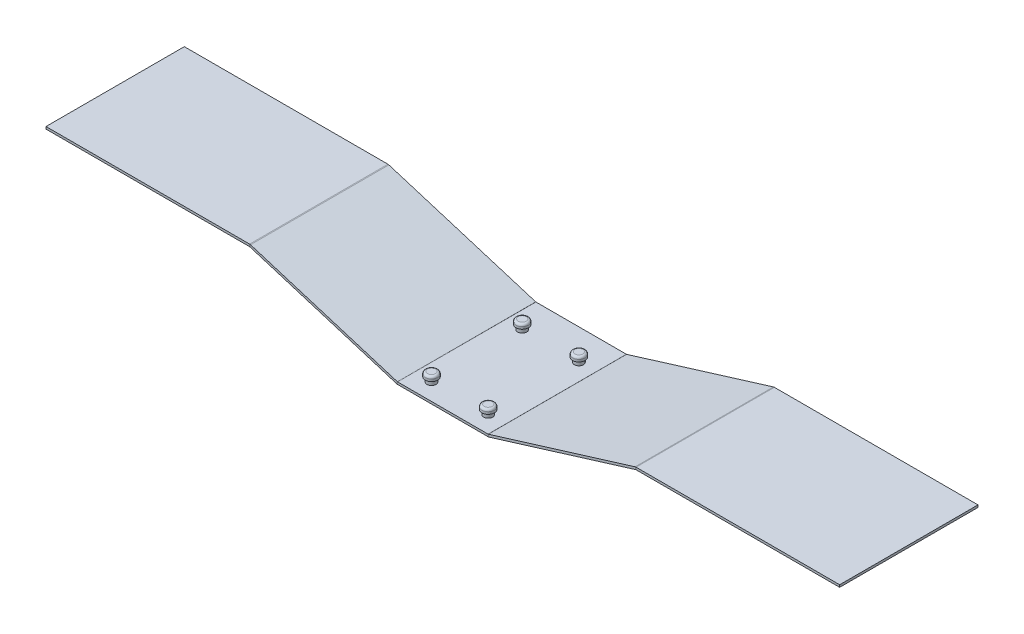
ISO-10303-21;
HEADER;
FILE_DESCRIPTION(('STEP AP214'),'2;1');
FILE_NAME('part.step','',(''),(''),'','','');
FILE_SCHEMA(('AUTOMOTIVE_DESIGN { 1 0 10303 214 1 1 1 1 }'));
ENDSEC;
DATA;
#1=APPLICATION_CONTEXT('core data for automotive mechanical design processes');
#2=APPLICATION_PROTOCOL_DEFINITION('international standard','automotive_design',2000,#1);
#3=PRODUCT_CONTEXT('',#1,'mechanical');
#4=PRODUCT('Part','Part','',(#3));
#5=PRODUCT_RELATED_PRODUCT_CATEGORY('part','',(#4));
#6=PRODUCT_DEFINITION_FORMATION('','',#4);
#7=PRODUCT_DEFINITION_CONTEXT('part definition',#1,'design');
#8=PRODUCT_DEFINITION('design','',#6,#7);
#9=PRODUCT_DEFINITION_SHAPE('','',#8);
#10=(LENGTH_UNIT() NAMED_UNIT(*) SI_UNIT(.MILLI.,.METRE.));
#11=(NAMED_UNIT(*) PLANE_ANGLE_UNIT() SI_UNIT($,.RADIAN.));
#12=(NAMED_UNIT(*) SI_UNIT($,.STERADIAN.) SOLID_ANGLE_UNIT());
#13=UNCERTAINTY_MEASURE_WITH_UNIT(LENGTH_MEASURE(1.E-05),#10,'distance_accuracy_value','');
#14=(GEOMETRIC_REPRESENTATION_CONTEXT(3) GLOBAL_UNCERTAINTY_ASSIGNED_CONTEXT((#13)) GLOBAL_UNIT_ASSIGNED_CONTEXT((#10,
#11,#12)) REPRESENTATION_CONTEXT('',''));
#15=CARTESIAN_POINT('',(0.,0.,0.));
#16=DIRECTION('',(0.,0.,1.));
#17=DIRECTION('',(1.,0.,0.));
#18=AXIS2_PLACEMENT_3D('',#15,#16,#17);
#19=CARTESIAN_POINT('',(180.393299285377,-0.121015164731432,122.));
#20=DIRECTION('',(0.,0.,1.));
#21=DIRECTION('',(1.,0.,0.));
#22=AXIS2_PLACEMENT_3D('',#19,#20,#21);
#23=PLANE('',#22);
#24=DIRECTION('',(-0.294085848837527,-0.955779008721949,0.));
#25=VECTOR('',#24,1.);
#26=CARTESIAN_POINT('',(180.393299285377,-0.121015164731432,122.));
#27=LINE('',#26,#25);
#28=CARTESIAN_POINT('',(180.393299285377,-0.121015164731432,122.));
#29=VERTEX_POINT('',#28);
#30=CARTESIAN_POINT('',(179.805127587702,-2.03257318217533,122.));
#31=VERTEX_POINT('',#30);
#32=EDGE_CURVE('E350',#29,#31,#27,.T.);
#33=ORIENTED_EDGE('',*,*,#32,.F.);
#34=CARTESIAN_POINT('',(179.588503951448,-2.73659999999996,122.));
#35=DIRECTION('',(0.,0.,1.));
#36=DIRECTION('',(1.,0.,0.));
#37=AXIS2_PLACEMENT_3D('',#34,#35,#36);
#38=CIRCLE('',#37,2.7366);
#39=CARTESIAN_POINT('',(179.588503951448,0.,122.));
#40=VERTEX_POINT('',#39);
#41=EDGE_CURVE('E630',#40,#29,#38,.F.);
#42=ORIENTED_EDGE('',*,*,#41,.F.);
#43=DIRECTION('',(0.,1.,0.));
#44=VECTOR('',#43,1.);
#45=CARTESIAN_POINT('',(179.588503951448,-1.99999999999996,122.));
#46=LINE('',#45,#44);
#47=CARTESIAN_POINT('',(179.588503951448,-1.99999999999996,122.));
#48=VERTEX_POINT('',#47);
#49=EDGE_CURVE('E348',#48,#40,#46,.T.);
#50=ORIENTED_EDGE('',*,*,#49,.F.);
#51=CARTESIAN_POINT('',(179.588503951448,-2.73659999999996,122.));
#52=DIRECTION('',(0.,0.,1.));
#53=DIRECTION('',(1.,0.,0.));
#54=AXIS2_PLACEMENT_3D('',#51,#52,#53);
#55=CIRCLE('',#54,0.7366);
#56=EDGE_CURVE('E639',#48,#31,#55,.F.);
#57=ORIENTED_EDGE('',*,*,#56,.T.);
#58=EDGE_LOOP('',(#33,#42,#50,#57));
#59=FACE_BOUND('',#58,.T.);
#60=ADVANCED_FACE('F34',(#59),#23,.T.);
#61=CARTESIAN_POINT('',(179.588503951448,-1.99999999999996,122.));
#62=DIRECTION('',(0.,0.,1.));
#63=DIRECTION('',(1.,0.,0.));
#64=AXIS2_PLACEMENT_3D('',#61,#62,#63);
#65=PLANE('',#64);
#66=DIRECTION('',(0.95577900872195,-0.294085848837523,0.));
#67=VECTOR('',#66,1.);
#68=CARTESIAN_POINT('',(180.,0.,122.));
#69=LINE('',#68,#67);
#70=CARTESIAN_POINT('',(309.89413715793,-39.9674268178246,122.));
#71=VERTEX_POINT('',#70);
#72=EDGE_CURVE('E634',#29,#71,#69,.T.);
#73=ORIENTED_EDGE('',*,*,#72,.F.);
#74=ORIENTED_EDGE('',*,*,#32,.T.);
#75=DIRECTION('',(0.95577900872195,-0.294085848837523,0.));
#76=VECTOR('',#75,1.);
#77=CARTESIAN_POINT('',(179.411828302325,-1.9115580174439,122.));
#78=LINE('',#77,#76);
#79=CARTESIAN_POINT('',(309.305965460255,-41.8789848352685,122.));
#80=VERTEX_POINT('',#79);
#81=EDGE_CURVE('E642',#31,#80,#78,.T.);
#82=ORIENTED_EDGE('',*,*,#81,.T.);
#83=DIRECTION('',(0.294085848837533,0.955779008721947,0.));
#84=VECTOR('',#83,1.);
#85=CARTESIAN_POINT('',(309.305965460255,-41.8789848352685,122.));
#86=LINE('',#85,#84);
#87=EDGE_CURVE('E340',#80,#71,#86,.T.);
#88=ORIENTED_EDGE('',*,*,#87,.T.);
#89=EDGE_LOOP('',(#73,#74,#82,#88));
#90=FACE_BOUND('',#89,.T.);
#91=ADVANCED_FACE('F407',(#90),#65,.T.);
#92=CARTESIAN_POINT('',(179.588503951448,0.,0.));
#93=DIRECTION('',(0.,0.,-1.));
#94=DIRECTION('',(-1.,0.,0.));
#95=AXIS2_PLACEMENT_3D('',#92,#93,#94);
#96=PLANE('',#95);
#97=DIRECTION('',(0.,-1.,0.));
#98=VECTOR('',#97,1.);
#99=CARTESIAN_POINT('',(179.588503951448,0.,0.));
#100=LINE('',#99,#98);
#101=CARTESIAN_POINT('',(179.588503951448,0.,0.));
#102=VERTEX_POINT('',#101);
#103=CARTESIAN_POINT('',(179.588503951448,-1.99999999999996,0.));
#104=VERTEX_POINT('',#103);
#105=EDGE_CURVE('E346',#102,#104,#100,.T.);
#106=ORIENTED_EDGE('',*,*,#105,.F.);
#107=CARTESIAN_POINT('',(179.588503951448,-2.73659999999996,0.));
#108=DIRECTION('',(0.,0.,1.));
#109=DIRECTION('',(1.,0.,0.));
#110=AXIS2_PLACEMENT_3D('',#107,#108,#109);
#111=CIRCLE('',#110,2.7366);
#112=CARTESIAN_POINT('',(180.393299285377,-0.121015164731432,0.));
#113=VERTEX_POINT('',#112);
#114=EDGE_CURVE('E250',#102,#113,#111,.F.);
#115=ORIENTED_EDGE('',*,*,#114,.T.);
#116=DIRECTION('',(0.294085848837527,0.955779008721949,0.));
#117=VECTOR('',#116,1.);
#118=CARTESIAN_POINT('',(179.805127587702,-2.03257318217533,0.));
#119=LINE('',#118,#117);
#120=CARTESIAN_POINT('',(179.805127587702,-2.03257318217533,0.));
#121=VERTEX_POINT('',#120);
#122=EDGE_CURVE('E344',#121,#113,#119,.T.);
#123=ORIENTED_EDGE('',*,*,#122,.F.);
#124=CARTESIAN_POINT('',(179.588503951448,-2.73659999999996,0.));
#125=DIRECTION('',(0.,0.,1.));
#126=DIRECTION('',(1.,0.,0.));
#127=AXIS2_PLACEMENT_3D('',#124,#125,#126);
#128=CIRCLE('',#127,0.7366);
#129=EDGE_CURVE('E262',#104,#121,#128,.F.);
#130=ORIENTED_EDGE('',*,*,#129,.F.);
#131=EDGE_LOOP('',(#106,#115,#123,#130));
#132=FACE_BOUND('',#131,.T.);
#133=ADVANCED_FACE('F413',(#132),#96,.T.);
#134=CARTESIAN_POINT('',(179.805127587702,-2.03257318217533,0.));
#135=DIRECTION('',(0.,0.,-1.));
#136=DIRECTION('',(-1.,0.,0.));
#137=AXIS2_PLACEMENT_3D('',#134,#135,#136);
#138=PLANE('',#137);
#139=DIRECTION('',(1.,0.,0.));
#140=VECTOR('',#139,1.);
#141=CARTESIAN_POINT('',(0.,0.,0.));
#142=LINE('',#141,#140);
#143=CARTESIAN_POINT('',(0.,0.,0.));
#144=VERTEX_POINT('',#143);
#145=EDGE_CURVE('E253',#144,#102,#142,.T.);
#146=ORIENTED_EDGE('',*,*,#145,.T.);
#147=ORIENTED_EDGE('',*,*,#105,.T.);
#148=DIRECTION('',(1.,0.,0.));
#149=VECTOR('',#148,1.);
#150=CARTESIAN_POINT('',(0.,-2.,0.));
#151=LINE('',#150,#149);
#152=CARTESIAN_POINT('',(0.,-2.,0.));
#153=VERTEX_POINT('',#152);
#154=EDGE_CURVE('E259',#153,#104,#151,.T.);
#155=ORIENTED_EDGE('',*,*,#154,.F.);
#156=DIRECTION('',(0.,1.,0.));
#157=VECTOR('',#156,1.);
#158=CARTESIAN_POINT('',(0.,-2.,0.));
#159=LINE('',#158,#157);
#160=EDGE_CURVE('E256',#153,#144,#159,.T.);
#161=ORIENTED_EDGE('',*,*,#160,.T.);
#162=EDGE_LOOP('',(#146,#147,#155,#161));
#163=FACE_BOUND('',#162,.T.);
#164=ADVANCED_FACE('F604',(#163),#138,.T.);
#165=CARTESIAN_POINT('',(310.110760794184,-40.,122.));
#166=DIRECTION('',(0.,0.,1.));
#167=DIRECTION('',(1.,0.,0.));
#168=AXIS2_PLACEMENT_3D('',#165,#166,#167);
#169=PLANE('',#168);
#170=DIRECTION('',(0.,-1.,0.));
#171=VECTOR('',#170,1.);
#172=CARTESIAN_POINT('',(310.110760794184,-40.,122.));
#173=LINE('',#172,#171);
#174=CARTESIAN_POINT('',(310.110760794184,-40.,122.));
#175=VERTEX_POINT('',#174);
#176=CARTESIAN_POINT('',(310.110760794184,-42.,122.));
#177=VERTEX_POINT('',#176);
#178=EDGE_CURVE('E342',#175,#177,#173,.T.);
#179=ORIENTED_EDGE('',*,*,#178,.F.);
#180=CARTESIAN_POINT('',(310.110760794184,-39.2634,122.));
#181=DIRECTION('',(0.,0.,-1.));
#182=DIRECTION('',(-1.,0.,0.));
#183=AXIS2_PLACEMENT_3D('',#180,#181,#182);
#184=CIRCLE('',#183,0.7366);
#185=EDGE_CURVE('E680',#71,#175,#184,.F.);
#186=ORIENTED_EDGE('',*,*,#185,.F.);
#187=ORIENTED_EDGE('',*,*,#87,.F.);
#188=CARTESIAN_POINT('',(310.110760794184,-39.2634,122.));
#189=DIRECTION('',(0.,0.,1.));
#190=DIRECTION('',(1.,0.,0.));
#191=AXIS2_PLACEMENT_3D('',#188,#189,#190);
#192=CIRCLE('',#191,2.7366);
#193=EDGE_CURVE('E645',#80,#177,#192,.T.);
#194=ORIENTED_EDGE('',*,*,#193,.T.);
#195=EDGE_LOOP('',(#179,#186,#187,#194));
#196=FACE_BOUND('',#195,.T.);
#197=ADVANCED_FACE('F600',(#196),#169,.T.);
#198=CARTESIAN_POINT('',(309.305965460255,-41.8789848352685,122.));
#199=DIRECTION('',(0.,0.,1.));
#200=DIRECTION('',(1.,0.,0.));
#201=AXIS2_PLACEMENT_3D('',#198,#199,#200);
#202=PLANE('',#201);
#203=DIRECTION('',(1.,0.,0.));
#204=VECTOR('',#203,1.);
#205=CARTESIAN_POINT('',(310.,-40.,122.));
#206=LINE('',#205,#204);
#207=CARTESIAN_POINT('',(389.889239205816,-40.,122.));
#208=VERTEX_POINT('',#207);
#209=EDGE_CURVE('E677',#175,#208,#206,.T.);
#210=ORIENTED_EDGE('',*,*,#209,.F.);
#211=ORIENTED_EDGE('',*,*,#178,.T.);
#212=DIRECTION('',(1.,0.,0.));
#213=VECTOR('',#212,1.);
#214=CARTESIAN_POINT('',(310.,-42.,122.));
#215=LINE('',#214,#213);
#216=CARTESIAN_POINT('',(389.889239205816,-42.,122.));
#217=VERTEX_POINT('',#216);
#218=EDGE_CURVE('E203',#177,#217,#215,.T.);
#219=ORIENTED_EDGE('',*,*,#218,.T.);
#220=DIRECTION('',(0.,1.,0.));
#221=VECTOR('',#220,1.);
#222=CARTESIAN_POINT('',(389.889239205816,-42.,122.));
#223=LINE('',#222,#221);
#224=EDGE_CURVE('E194',#217,#208,#223,.T.);
#225=ORIENTED_EDGE('',*,*,#224,.T.);
#226=EDGE_LOOP('',(#210,#211,#219,#225));
#227=FACE_BOUND('',#226,.T.);
#228=ADVANCED_FACE('F596',(#227),#202,.T.);
#229=CARTESIAN_POINT('',(309.89413715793,-39.9674268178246,0.));
#230=DIRECTION('',(0.,0.,-1.));
#231=DIRECTION('',(-1.,0.,0.));
#232=AXIS2_PLACEMENT_3D('',#229,#230,#231);
#233=PLANE('',#232);
#234=DIRECTION('',(-0.294085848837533,-0.955779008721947,0.));
#235=VECTOR('',#234,1.);
#236=CARTESIAN_POINT('',(309.89413715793,-39.9674268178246,0.));
#237=LINE('',#236,#235);
#238=CARTESIAN_POINT('',(309.89413715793,-39.9674268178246,0.));
#239=VERTEX_POINT('',#238);
#240=CARTESIAN_POINT('',(309.305965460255,-41.8789848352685,0.));
#241=VERTEX_POINT('',#240);
#242=EDGE_CURVE('E338',#239,#241,#237,.T.);
#243=ORIENTED_EDGE('',*,*,#242,.F.);
#244=CARTESIAN_POINT('',(310.110760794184,-39.2634,0.));
#245=DIRECTION('',(0.,0.,-1.));
#246=DIRECTION('',(-1.,0.,0.));
#247=AXIS2_PLACEMENT_3D('',#244,#245,#246);
#248=CIRCLE('',#247,0.7366);
#249=CARTESIAN_POINT('',(310.110760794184,-40.,0.));
#250=VERTEX_POINT('',#249);
#251=EDGE_CURVE('E244',#239,#250,#248,.F.);
#252=ORIENTED_EDGE('',*,*,#251,.T.);
#253=DIRECTION('',(0.,1.,0.));
#254=VECTOR('',#253,1.);
#255=CARTESIAN_POINT('',(310.110760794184,-42.,0.));
#256=LINE('',#255,#254);
#257=CARTESIAN_POINT('',(310.110760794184,-42.,0.));
#258=VERTEX_POINT('',#257);
#259=EDGE_CURVE('E193',#258,#250,#256,.T.);
#260=ORIENTED_EDGE('',*,*,#259,.F.);
#261=CARTESIAN_POINT('',(310.110760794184,-39.2634,0.));
#262=DIRECTION('',(0.,0.,1.));
#263=DIRECTION('',(1.,0.,0.));
#264=AXIS2_PLACEMENT_3D('',#261,#262,#263);
#265=CIRCLE('',#264,2.7366);
#266=EDGE_CURVE('E268',#241,#258,#265,.T.);
#267=ORIENTED_EDGE('',*,*,#266,.F.);
#268=EDGE_LOOP('',(#243,#252,#260,#267));
#269=FACE_BOUND('',#268,.T.);
#270=ADVANCED_FACE('F592',(#269),#233,.T.);
#271=CARTESIAN_POINT('',(310.110760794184,-42.,0.));
#272=DIRECTION('',(0.,0.,-1.));
#273=DIRECTION('',(-1.,0.,0.));
#274=AXIS2_PLACEMENT_3D('',#271,#272,#273);
#275=PLANE('',#274);
#276=DIRECTION('',(0.95577900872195,-0.294085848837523,0.));
#277=VECTOR('',#276,1.);
#278=CARTESIAN_POINT('',(180.,0.,0.));
#279=LINE('',#278,#277);
#280=EDGE_CURVE('E247',#113,#239,#279,.T.);
#281=ORIENTED_EDGE('',*,*,#280,.T.);
#282=ORIENTED_EDGE('',*,*,#242,.T.);
#283=DIRECTION('',(0.95577900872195,-0.294085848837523,0.));
#284=VECTOR('',#283,1.);
#285=CARTESIAN_POINT('',(179.411828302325,-1.9115580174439,0.));
#286=LINE('',#285,#284);
#287=EDGE_CURVE('E265',#121,#241,#286,.T.);
#288=ORIENTED_EDGE('',*,*,#287,.F.);
#289=ORIENTED_EDGE('',*,*,#122,.T.);
#290=EDGE_LOOP('',(#281,#282,#288,#289));
#291=FACE_BOUND('',#290,.T.);
#292=ADVANCED_FACE('F589',(#291),#275,.T.);
#293=CARTESIAN_POINT('',(390.10586284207,-39.9674268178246,122.));
#294=DIRECTION('',(0.,0.,1.));
#295=DIRECTION('',(1.,0.,0.));
#296=AXIS2_PLACEMENT_3D('',#293,#294,#295);
#297=PLANE('',#296);
#298=DIRECTION('',(0.294085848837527,-0.955779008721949,0.));
#299=VECTOR('',#298,1.);
#300=CARTESIAN_POINT('',(390.10586284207,-39.9674268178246,122.));
#301=LINE('',#300,#299);
#302=CARTESIAN_POINT('',(390.10586284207,-39.9674268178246,122.));
#303=VERTEX_POINT('',#302);
#304=CARTESIAN_POINT('',(390.694034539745,-41.8789848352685,122.));
#305=VERTEX_POINT('',#304);
#306=EDGE_CURVE('E181',#303,#305,#301,.T.);
#307=ORIENTED_EDGE('',*,*,#306,.F.);
#308=CARTESIAN_POINT('',(389.889239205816,-39.2634,122.));
#309=DIRECTION('',(0.,0.,-1.));
#310=DIRECTION('',(-1.,0.,0.));
#311=AXIS2_PLACEMENT_3D('',#308,#309,#310);
#312=CIRCLE('',#311,0.7366);
#313=EDGE_CURVE('E654',#208,#303,#312,.F.);
#314=ORIENTED_EDGE('',*,*,#313,.F.);
#315=ORIENTED_EDGE('',*,*,#224,.F.);
#316=CARTESIAN_POINT('',(389.889239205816,-39.2634,122.));
#317=DIRECTION('',(0.,0.,1.));
#318=DIRECTION('',(1.,0.,0.));
#319=AXIS2_PLACEMENT_3D('',#316,#317,#318);
#320=CIRCLE('',#319,2.7366);
#321=EDGE_CURVE('E197',#217,#305,#320,.T.);
#322=ORIENTED_EDGE('',*,*,#321,.T.);
#323=EDGE_LOOP('',(#307,#314,#315,#322));
#324=FACE_BOUND('',#323,.T.);
#325=ADVANCED_FACE('F199',(#324),#297,.T.);
#326=CARTESIAN_POINT('',(389.889239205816,-42.,122.));
#327=DIRECTION('',(0.,0.,1.));
#328=DIRECTION('',(1.,0.,0.));
#329=AXIS2_PLACEMENT_3D('',#326,#327,#328);
#330=PLANE('',#329);
#331=DIRECTION('',(0.95577900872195,0.294085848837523,0.));
#332=VECTOR('',#331,1.);
#333=CARTESIAN_POINT('',(390.,-40.,122.));
#334=LINE('',#333,#332);
#335=CARTESIAN_POINT('',(519.606700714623,-0.121015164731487,122.));
#336=VERTEX_POINT('',#335);
#337=EDGE_CURVE('E188',#303,#336,#334,.T.);
#338=ORIENTED_EDGE('',*,*,#337,.F.);
#339=ORIENTED_EDGE('',*,*,#306,.T.);
#340=DIRECTION('',(0.95577900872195,0.294085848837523,0.));
#341=VECTOR('',#340,1.);
#342=CARTESIAN_POINT('',(390.588171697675,-41.9115580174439,122.));
#343=LINE('',#342,#341);
#344=CARTESIAN_POINT('',(520.194872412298,-2.0325731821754,122.));
#345=VERTEX_POINT('',#344);
#346=EDGE_CURVE('E185',#305,#345,#343,.T.);
#347=ORIENTED_EDGE('',*,*,#346,.T.);
#348=DIRECTION('',(-0.2940858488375,0.955779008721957,0.));
#349=VECTOR('',#348,1.);
#350=CARTESIAN_POINT('',(520.194872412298,-2.0325731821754,122.));
#351=LINE('',#350,#349);
#352=EDGE_CURVE('E329',#345,#336,#351,.T.);
#353=ORIENTED_EDGE('',*,*,#352,.T.);
#354=EDGE_LOOP('',(#338,#339,#347,#353));
#355=FACE_BOUND('',#354,.T.);
#356=ADVANCED_FACE('F183',(#355),#330,.T.);
#357=CARTESIAN_POINT('',(389.889239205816,-40.,0.));
#358=DIRECTION('',(0.,0.,-1.));
#359=DIRECTION('',(-1.,0.,0.));
#360=AXIS2_PLACEMENT_3D('',#357,#358,#359);
#361=PLANE('',#360);
#362=DIRECTION('',(0.,-1.,0.));
#363=VECTOR('',#362,1.);
#364=CARTESIAN_POINT('',(389.889239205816,-40.,0.));
#365=LINE('',#364,#363);
#366=CARTESIAN_POINT('',(389.889239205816,-40.,0.));
#367=VERTEX_POINT('',#366);
#368=CARTESIAN_POINT('',(389.889239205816,-42.,0.));
#369=VERTEX_POINT('',#368);
#370=EDGE_CURVE('E334',#367,#369,#365,.T.);
#371=ORIENTED_EDGE('',*,*,#370,.F.);
#372=CARTESIAN_POINT('',(389.889239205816,-39.2634,0.));
#373=DIRECTION('',(0.,0.,-1.));
#374=DIRECTION('',(-1.,0.,0.));
#375=AXIS2_PLACEMENT_3D('',#372,#373,#374);
#376=CIRCLE('',#375,0.7366);
#377=CARTESIAN_POINT('',(390.10586284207,-39.9674268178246,0.));
#378=VERTEX_POINT('',#377);
#379=EDGE_CURVE('E238',#367,#378,#376,.F.);
#380=ORIENTED_EDGE('',*,*,#379,.T.);
#381=DIRECTION('',(-0.294085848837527,0.955779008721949,0.));
#382=VECTOR('',#381,1.);
#383=CARTESIAN_POINT('',(390.694034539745,-41.8789848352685,0.));
#384=LINE('',#383,#382);
#385=CARTESIAN_POINT('',(390.694034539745,-41.8789848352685,0.));
#386=VERTEX_POINT('',#385);
#387=EDGE_CURVE('E332',#386,#378,#384,.T.);
#388=ORIENTED_EDGE('',*,*,#387,.F.);
#389=CARTESIAN_POINT('',(389.889239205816,-39.2634,0.));
#390=DIRECTION('',(0.,0.,1.));
#391=DIRECTION('',(1.,0.,0.));
#392=AXIS2_PLACEMENT_3D('',#389,#390,#391);
#393=CIRCLE('',#392,2.7366);
#394=EDGE_CURVE('E210',#369,#386,#393,.T.);
#395=ORIENTED_EDGE('',*,*,#394,.F.);
#396=EDGE_LOOP('',(#371,#380,#388,#395));
#397=FACE_BOUND('',#396,.T.);
#398=ADVANCED_FACE('F580',(#397),#361,.T.);
#399=CARTESIAN_POINT('',(390.694034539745,-41.8789848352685,0.));
#400=DIRECTION('',(0.,0.,-1.));
#401=DIRECTION('',(-1.,0.,0.));
#402=AXIS2_PLACEMENT_3D('',#399,#400,#401);
#403=PLANE('',#402);
#404=DIRECTION('',(1.,0.,0.));
#405=VECTOR('',#404,1.);
#406=CARTESIAN_POINT('',(310.,-40.,0.));
#407=LINE('',#406,#405);
#408=EDGE_CURVE('E241',#250,#367,#407,.T.);
#409=ORIENTED_EDGE('',*,*,#408,.T.);
#410=ORIENTED_EDGE('',*,*,#370,.T.);
#411=DIRECTION('',(1.,0.,0.));
#412=VECTOR('',#411,1.);
#413=CARTESIAN_POINT('',(310.,-42.,0.));
#414=LINE('',#413,#412);
#415=EDGE_CURVE('E271',#258,#369,#414,.T.);
#416=ORIENTED_EDGE('',*,*,#415,.F.);
#417=ORIENTED_EDGE('',*,*,#259,.T.);
#418=EDGE_LOOP('',(#409,#410,#416,#417));
#419=FACE_BOUND('',#418,.T.);
#420=ADVANCED_FACE('F576',(#419),#403,.T.);
#421=CARTESIAN_POINT('',(520.411496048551,0.,122.));
#422=DIRECTION('',(0.,0.,1.));
#423=DIRECTION('',(1.,0.,0.));
#424=AXIS2_PLACEMENT_3D('',#421,#422,#423);
#425=PLANE('',#424);
#426=DIRECTION('',(0.,-1.,0.));
#427=VECTOR('',#426,1.);
#428=CARTESIAN_POINT('',(520.411496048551,0.,122.));
#429=LINE('',#428,#427);
#430=CARTESIAN_POINT('',(520.411496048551,0.,122.));
#431=VERTEX_POINT('',#430);
#432=CARTESIAN_POINT('',(520.411496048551,-2.,122.));
#433=VERTEX_POINT('',#432);
#434=EDGE_CURVE('E51',#431,#433,#429,.T.);
#435=ORIENTED_EDGE('',*,*,#434,.F.);
#436=CARTESIAN_POINT('',(520.411496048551,-2.73659999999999,122.));
#437=DIRECTION('',(0.,0.,1.));
#438=DIRECTION('',(1.,0.,0.));
#439=AXIS2_PLACEMENT_3D('',#436,#437,#438);
#440=CIRCLE('',#439,2.7366);
#441=EDGE_CURVE('E669',#336,#431,#440,.F.);
#442=ORIENTED_EDGE('',*,*,#441,.F.);
#443=ORIENTED_EDGE('',*,*,#352,.F.);
#444=CARTESIAN_POINT('',(520.411496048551,-2.73659999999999,122.));
#445=DIRECTION('',(0.,0.,1.));
#446=DIRECTION('',(1.,0.,0.));
#447=AXIS2_PLACEMENT_3D('',#444,#445,#446);
#448=CIRCLE('',#447,0.7366);
#449=EDGE_CURVE('E218',#345,#433,#448,.F.);
#450=ORIENTED_EDGE('',*,*,#449,.T.);
#451=EDGE_LOOP('',(#435,#442,#443,#450));
#452=FACE_BOUND('',#451,.T.);
#453=ADVANCED_FACE('F573',(#452),#425,.T.);
#454=CARTESIAN_POINT('',(520.194872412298,-2.0325731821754,122.));
#455=DIRECTION('',(0.,0.,1.));
#456=DIRECTION('',(1.,0.,0.));
#457=AXIS2_PLACEMENT_3D('',#454,#455,#456);
#458=PLANE('',#457);
#459=DIRECTION('',(1.,0.,0.));
#460=VECTOR('',#459,1.);
#461=CARTESIAN_POINT('',(520.,0.,122.));
#462=LINE('',#461,#460);
#463=CARTESIAN_POINT('',(700.,0.,122.));
#464=VERTEX_POINT('',#463);
#465=EDGE_CURVE('E667',#431,#464,#462,.T.);
#466=ORIENTED_EDGE('',*,*,#465,.F.);
#467=ORIENTED_EDGE('',*,*,#434,.T.);
#468=DIRECTION('',(1.,0.,0.));
#469=VECTOR('',#468,1.);
#470=CARTESIAN_POINT('',(520.,-2.,122.));
#471=LINE('',#470,#469);
#472=CARTESIAN_POINT('',(700.,-2.,122.));
#473=VERTEX_POINT('',#472);
#474=EDGE_CURVE('E129',#433,#473,#471,.T.);
#475=ORIENTED_EDGE('',*,*,#474,.T.);
#476=DIRECTION('',(0.,-1.,0.));
#477=VECTOR('',#476,1.);
#478=CARTESIAN_POINT('',(700.,0.,122.));
#479=LINE('',#478,#477);
#480=EDGE_CURVE('E665',#464,#473,#479,.T.);
#481=ORIENTED_EDGE('',*,*,#480,.F.);
#482=EDGE_LOOP('',(#466,#467,#475,#481));
#483=FACE_BOUND('',#482,.T.);
#484=ADVANCED_FACE('F570',(#483),#458,.T.);
#485=CARTESIAN_POINT('',(519.606700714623,-0.121015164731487,0.));
#486=DIRECTION('',(0.,0.,-1.));
#487=DIRECTION('',(-1.,0.,0.));
#488=AXIS2_PLACEMENT_3D('',#485,#486,#487);
#489=PLANE('',#488);
#490=DIRECTION('',(0.2940858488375,-0.955779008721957,0.));
#491=VECTOR('',#490,1.);
#492=CARTESIAN_POINT('',(519.606700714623,-0.121015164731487,0.));
#493=LINE('',#492,#491);
#494=CARTESIAN_POINT('',(519.606700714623,-0.121015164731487,0.));
#495=VERTEX_POINT('',#494);
#496=CARTESIAN_POINT('',(520.194872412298,-2.0325731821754,0.));
#497=VERTEX_POINT('',#496);
#498=EDGE_CURVE('E116',#495,#497,#493,.T.);
#499=ORIENTED_EDGE('',*,*,#498,.F.);
#500=CARTESIAN_POINT('',(520.411496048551,-2.73659999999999,0.));
#501=DIRECTION('',(0.,0.,1.));
#502=DIRECTION('',(1.,0.,0.));
#503=AXIS2_PLACEMENT_3D('',#500,#501,#502);
#504=CIRCLE('',#503,2.7366);
#505=CARTESIAN_POINT('',(520.411496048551,0.,0.));
#506=VERTEX_POINT('',#505);
#507=EDGE_CURVE('E234',#495,#506,#504,.F.);
#508=ORIENTED_EDGE('',*,*,#507,.T.);
#509=DIRECTION('',(0.,1.,0.));
#510=VECTOR('',#509,1.);
#511=CARTESIAN_POINT('',(520.411496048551,-2.,0.));
#512=LINE('',#511,#510);
#513=CARTESIAN_POINT('',(520.411496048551,-2.,0.));
#514=VERTEX_POINT('',#513);
#515=EDGE_CURVE('E123',#514,#506,#512,.T.);
#516=ORIENTED_EDGE('',*,*,#515,.F.);
#517=CARTESIAN_POINT('',(520.411496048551,-2.73659999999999,0.));
#518=DIRECTION('',(0.,0.,1.));
#519=DIRECTION('',(1.,0.,0.));
#520=AXIS2_PLACEMENT_3D('',#517,#518,#519);
#521=CIRCLE('',#520,0.7366);
#522=EDGE_CURVE('E277',#497,#514,#521,.F.);
#523=ORIENTED_EDGE('',*,*,#522,.F.);
#524=EDGE_LOOP('',(#499,#508,#516,#523));
#525=FACE_BOUND('',#524,.T.);
#526=ADVANCED_FACE('F567',(#525),#489,.T.);
#527=CARTESIAN_POINT('',(520.411496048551,-2.,0.));
#528=DIRECTION('',(0.,0.,-1.));
#529=DIRECTION('',(-1.,0.,0.));
#530=AXIS2_PLACEMENT_3D('',#527,#528,#529);
#531=PLANE('',#530);
#532=DIRECTION('',(0.95577900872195,0.294085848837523,0.));
#533=VECTOR('',#532,1.);
#534=CARTESIAN_POINT('',(390.,-40.,0.));
#535=LINE('',#534,#533);
#536=EDGE_CURVE('E236',#378,#495,#535,.T.);
#537=ORIENTED_EDGE('',*,*,#536,.T.);
#538=ORIENTED_EDGE('',*,*,#498,.T.);
#539=DIRECTION('',(0.95577900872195,0.294085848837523,0.));
#540=VECTOR('',#539,1.);
#541=CARTESIAN_POINT('',(390.588171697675,-41.9115580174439,0.));
#542=LINE('',#541,#540);
#543=EDGE_CURVE('E275',#386,#497,#542,.T.);
#544=ORIENTED_EDGE('',*,*,#543,.F.);
#545=ORIENTED_EDGE('',*,*,#387,.T.);
#546=EDGE_LOOP('',(#537,#538,#544,#545));
#547=FACE_BOUND('',#546,.T.);
#548=ADVANCED_FACE('F563',(#547),#531,.T.);
#549=CARTESIAN_POINT('',(520.,-2.,122.));
#550=DIRECTION('',(0.,1.,0.));
#551=DIRECTION('',(0.,0.,1.));
#552=AXIS2_PLACEMENT_3D('',#549,#550,#551);
#553=PLANE('',#552);
#554=DIRECTION('',(1.,0.,0.));
#555=VECTOR('',#554,1.);
#556=CARTESIAN_POINT('',(520.,-2.,0.));
#557=LINE('',#556,#555);
#558=CARTESIAN_POINT('',(700.,-2.,0.));
#559=VERTEX_POINT('',#558);
#560=EDGE_CURVE('E224',#514,#559,#557,.T.);
#561=ORIENTED_EDGE('',*,*,#560,.T.);
#562=DIRECTION('',(0.,0.,-1.));
#563=VECTOR('',#562,1.);
#564=CARTESIAN_POINT('',(700.,-2.,122.));
#565=LINE('',#564,#563);
#566=EDGE_CURVE('E325',#473,#559,#565,.T.);
#567=ORIENTED_EDGE('',*,*,#566,.F.);
#568=ORIENTED_EDGE('',*,*,#474,.F.);
#569=DIRECTION('',(0.,0.,-1.));
#570=VECTOR('',#569,1.);
#571=CARTESIAN_POINT('',(520.411496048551,-2.,122.));
#572=LINE('',#571,#570);
#573=EDGE_CURVE('E220',#433,#514,#572,.T.);
#574=ORIENTED_EDGE('',*,*,#573,.T.);
#575=EDGE_LOOP('',(#561,#567,#568,#574));
#576=FACE_BOUND('',#575,.T.);
#577=ADVANCED_FACE('F559',(#576),#553,.F.);
#578=CARTESIAN_POINT('',(700.,0.,122.));
#579=DIRECTION('',(1.,0.,0.));
#580=DIRECTION('',(0.,0.,-1.));
#581=AXIS2_PLACEMENT_3D('',#578,#579,#580);
#582=PLANE('',#581);
#583=DIRECTION('',(0.,-1.,0.));
#584=VECTOR('',#583,1.);
#585=CARTESIAN_POINT('',(700.,0.,0.));
#586=LINE('',#585,#584);
#587=CARTESIAN_POINT('',(700.,0.,0.));
#588=VERTEX_POINT('',#587);
#589=EDGE_CURVE('E227',#588,#559,#586,.T.);
#590=ORIENTED_EDGE('',*,*,#589,.F.);
#591=DIRECTION('',(0.,0.,-1.));
#592=VECTOR('',#591,1.);
#593=CARTESIAN_POINT('',(700.,0.,122.));
#594=LINE('',#593,#592);
#595=EDGE_CURVE('E323',#464,#588,#594,.T.);
#596=ORIENTED_EDGE('',*,*,#595,.F.);
#597=ORIENTED_EDGE('',*,*,#480,.T.);
#598=ORIENTED_EDGE('',*,*,#566,.T.);
#599=EDGE_LOOP('',(#590,#596,#597,#598));
#600=FACE_BOUND('',#599,.T.);
#601=ADVANCED_FACE('F555',(#600),#582,.T.);
#602=CARTESIAN_POINT('',(520.,0.,122.));
#603=DIRECTION('',(0.,1.,0.));
#604=DIRECTION('',(0.,0.,1.));
#605=AXIS2_PLACEMENT_3D('',#602,#603,#604);
#606=PLANE('',#605);
#607=DIRECTION('',(1.,0.,0.));
#608=VECTOR('',#607,1.);
#609=CARTESIAN_POINT('',(520.,0.,0.));
#610=LINE('',#609,#608);
#611=EDGE_CURVE('E231',#506,#588,#610,.T.);
#612=ORIENTED_EDGE('',*,*,#611,.F.);
#613=DIRECTION('',(0.,0.,-1.));
#614=VECTOR('',#613,1.);
#615=CARTESIAN_POINT('',(520.411496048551,0.,122.));
#616=LINE('',#615,#614);
#617=EDGE_CURVE('E320',#431,#506,#616,.T.);
#618=ORIENTED_EDGE('',*,*,#617,.F.);
#619=ORIENTED_EDGE('',*,*,#465,.T.);
#620=ORIENTED_EDGE('',*,*,#595,.T.);
#621=EDGE_LOOP('',(#612,#618,#619,#620));
#622=FACE_BOUND('',#621,.T.);
#623=ADVANCED_FACE('F551',(#622),#606,.T.);
#624=CARTESIAN_POINT('',(520.411496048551,-2.73659999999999,122.));
#625=DIRECTION('',(0.,0.,-1.));
#626=DIRECTION('',(-1.,0.,0.));
#627=AXIS2_PLACEMENT_3D('',#624,#625,#626);
#628=CYLINDRICAL_SURFACE('',#627,2.7366);
#629=ORIENTED_EDGE('',*,*,#507,.F.);
#630=DIRECTION('',(0.,0.,-1.));
#631=VECTOR('',#630,1.);
#632=CARTESIAN_POINT('',(519.606700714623,-0.121015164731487,122.));
#633=LINE('',#632,#631);
#634=EDGE_CURVE('E317',#336,#495,#633,.T.);
#635=ORIENTED_EDGE('',*,*,#634,.F.);
#636=ORIENTED_EDGE('',*,*,#441,.T.);
#637=ORIENTED_EDGE('',*,*,#617,.T.);
#638=EDGE_LOOP('',(#629,#635,#636,#637));
#639=FACE_BOUND('',#638,.T.);
#640=ADVANCED_FACE('F547',(#639),#628,.T.);
#641=CARTESIAN_POINT('',(390.,-40.,122.));
#642=DIRECTION('',(-0.294085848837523,0.95577900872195,0.));
#643=DIRECTION('',(-0.95577900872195,-0.294085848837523,0.));
#644=AXIS2_PLACEMENT_3D('',#641,#642,#643);
#645=PLANE('',#644);
#646=ORIENTED_EDGE('',*,*,#536,.F.);
#647=DIRECTION('',(0.,0.,-1.));
#648=VECTOR('',#647,1.);
#649=CARTESIAN_POINT('',(390.10586284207,-39.9674268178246,122.));
#650=LINE('',#649,#648);
#651=EDGE_CURVE('E314',#303,#378,#650,.T.);
#652=ORIENTED_EDGE('',*,*,#651,.F.);
#653=ORIENTED_EDGE('',*,*,#337,.T.);
#654=ORIENTED_EDGE('',*,*,#634,.T.);
#655=EDGE_LOOP('',(#646,#652,#653,#654));
#656=FACE_BOUND('',#655,.T.);
#657=ADVANCED_FACE('F543',(#656),#645,.T.);
#658=CARTESIAN_POINT('',(389.889239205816,-39.2634,122.));
#659=DIRECTION('',(0.,0.,-1.));
#660=DIRECTION('',(-1.,0.,0.));
#661=AXIS2_PLACEMENT_3D('',#658,#659,#660);
#662=CYLINDRICAL_SURFACE('',#661,0.7366);
#663=ORIENTED_EDGE('',*,*,#379,.F.);
#664=DIRECTION('',(0.,0.,-1.));
#665=VECTOR('',#664,1.);
#666=CARTESIAN_POINT('',(389.889239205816,-40.,122.));
#667=LINE('',#666,#665);
#668=EDGE_CURVE('E311',#208,#367,#667,.T.);
#669=ORIENTED_EDGE('',*,*,#668,.F.);
#670=ORIENTED_EDGE('',*,*,#313,.T.);
#671=ORIENTED_EDGE('',*,*,#651,.T.);
#672=EDGE_LOOP('',(#663,#669,#670,#671));
#673=FACE_BOUND('',#672,.T.);
#674=ADVANCED_FACE('F539',(#673),#662,.F.);
#675=CARTESIAN_POINT('',(310.,-40.,122.));
#676=DIRECTION('',(0.,1.,0.));
#677=DIRECTION('',(0.,0.,1.));
#678=AXIS2_PLACEMENT_3D('',#675,#676,#677);
#679=PLANE('',#678);
#680=CARTESIAN_POINT('',(375.,-40.,107.));
#681=DIRECTION('',(0.,1.,0.));
#682=DIRECTION('',(0.,0.,1.));
#683=AXIS2_PLACEMENT_3D('',#680,#681,#682);
#684=CIRCLE('',#683,3.99999999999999);
#685=CARTESIAN_POINT('',(375.,-40.,111.));
#686=VERTEX_POINT('',#685);
#687=EDGE_CURVE('E359',#686,#686,#684,.T.);
#688=ORIENTED_EDGE('',*,*,#687,.F.);
#689=EDGE_LOOP('',(#688));
#690=FACE_BOUND('',#689,.T.);
#691=CARTESIAN_POINT('',(325.,-40.,107.));
#692=DIRECTION('',(0.,1.,0.));
#693=DIRECTION('',(0.,0.,1.));
#694=AXIS2_PLACEMENT_3D('',#691,#692,#693);
#695=CIRCLE('',#694,3.99999999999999);
#696=CARTESIAN_POINT('',(325.,-40.,111.));
#697=VERTEX_POINT('',#696);
#698=EDGE_CURVE('E352',#697,#697,#695,.T.);
#699=ORIENTED_EDGE('',*,*,#698,.F.);
#700=EDGE_LOOP('',(#699));
#701=FACE_BOUND('',#700,.T.);
#702=ORIENTED_EDGE('',*,*,#408,.F.);
#703=DIRECTION('',(0.,0.,-1.));
#704=VECTOR('',#703,1.);
#705=CARTESIAN_POINT('',(310.110760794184,-40.,122.));
#706=LINE('',#705,#704);
#707=EDGE_CURVE('E308',#175,#250,#706,.T.);
#708=ORIENTED_EDGE('',*,*,#707,.F.);
#709=ORIENTED_EDGE('',*,*,#209,.T.);
#710=ORIENTED_EDGE('',*,*,#668,.T.);
#711=EDGE_LOOP('',(#702,#708,#709,#710));
#712=FACE_BOUND('',#711,.T.);
#713=CARTESIAN_POINT('',(325.,-40.,27.));
#714=DIRECTION('',(0.,1.,0.));
#715=DIRECTION('',(0.,0.,1.));
#716=AXIS2_PLACEMENT_3D('',#713,#714,#715);
#717=CIRCLE('',#716,3.99999999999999);
#718=CARTESIAN_POINT('',(325.,-40.,31.));
#719=VERTEX_POINT('',#718);
#720=EDGE_CURVE('E362',#719,#719,#717,.T.);
#721=ORIENTED_EDGE('',*,*,#720,.F.);
#722=EDGE_LOOP('',(#721));
#723=FACE_BOUND('',#722,.T.);
#724=CARTESIAN_POINT('',(375.,-40.,27.));
#725=DIRECTION('',(0.,1.,0.));
#726=DIRECTION('',(0.,0.,1.));
#727=AXIS2_PLACEMENT_3D('',#724,#725,#726);
#728=CIRCLE('',#727,3.99999999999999);
#729=CARTESIAN_POINT('',(375.,-40.,31.));
#730=VERTEX_POINT('',#729);
#731=EDGE_CURVE('E377',#730,#730,#728,.T.);
#732=ORIENTED_EDGE('',*,*,#731,.F.);
#733=EDGE_LOOP('',(#732));
#734=FACE_BOUND('',#733,.T.);
#735=ADVANCED_FACE('F535',(#690,#701,#712,#723,#734),#679,.T.);
#736=CARTESIAN_POINT('',(310.110760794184,-39.2634,122.));
#737=DIRECTION('',(0.,0.,-1.));
#738=DIRECTION('',(-1.,0.,0.));
#739=AXIS2_PLACEMENT_3D('',#736,#737,#738);
#740=CYLINDRICAL_SURFACE('',#739,0.7366);
#741=ORIENTED_EDGE('',*,*,#251,.F.);
#742=DIRECTION('',(0.,0.,-1.));
#743=VECTOR('',#742,1.);
#744=CARTESIAN_POINT('',(309.89413715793,-39.9674268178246,122.));
#745=LINE('',#744,#743);
#746=EDGE_CURVE('E305',#71,#239,#745,.T.);
#747=ORIENTED_EDGE('',*,*,#746,.F.);
#748=ORIENTED_EDGE('',*,*,#185,.T.);
#749=ORIENTED_EDGE('',*,*,#707,.T.);
#750=EDGE_LOOP('',(#741,#747,#748,#749));
#751=FACE_BOUND('',#750,.T.);
#752=ADVANCED_FACE('F531',(#751),#740,.F.);
#753=CARTESIAN_POINT('',(180.,0.,122.));
#754=DIRECTION('',(0.294085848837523,0.95577900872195,0.));
#755=DIRECTION('',(-0.95577900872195,0.294085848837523,0.));
#756=AXIS2_PLACEMENT_3D('',#753,#754,#755);
#757=PLANE('',#756);
#758=ORIENTED_EDGE('',*,*,#280,.F.);
#759=DIRECTION('',(0.,0.,-1.));
#760=VECTOR('',#759,1.);
#761=CARTESIAN_POINT('',(180.393299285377,-0.121015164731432,122.));
#762=LINE('',#761,#760);
#763=EDGE_CURVE('E302',#29,#113,#762,.T.);
#764=ORIENTED_EDGE('',*,*,#763,.F.);
#765=ORIENTED_EDGE('',*,*,#72,.T.);
#766=ORIENTED_EDGE('',*,*,#746,.T.);
#767=EDGE_LOOP('',(#758,#764,#765,#766));
#768=FACE_BOUND('',#767,.T.);
#769=ADVANCED_FACE('F527',(#768),#757,.T.);
#770=CARTESIAN_POINT('',(179.588503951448,-2.73659999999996,122.));
#771=DIRECTION('',(0.,0.,-1.));
#772=DIRECTION('',(-1.,0.,0.));
#773=AXIS2_PLACEMENT_3D('',#770,#771,#772);
#774=CYLINDRICAL_SURFACE('',#773,2.7366);
#775=ORIENTED_EDGE('',*,*,#114,.F.);
#776=DIRECTION('',(0.,0.,-1.));
#777=VECTOR('',#776,1.);
#778=CARTESIAN_POINT('',(179.588503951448,0.,122.));
#779=LINE('',#778,#777);
#780=EDGE_CURVE('E299',#40,#102,#779,.T.);
#781=ORIENTED_EDGE('',*,*,#780,.F.);
#782=ORIENTED_EDGE('',*,*,#41,.T.);
#783=ORIENTED_EDGE('',*,*,#763,.T.);
#784=EDGE_LOOP('',(#775,#781,#782,#783));
#785=FACE_BOUND('',#784,.T.);
#786=ADVANCED_FACE('F523',(#785),#774,.T.);
#787=CARTESIAN_POINT('',(0.,0.,122.));
#788=DIRECTION('',(0.,1.,0.));
#789=DIRECTION('',(0.,0.,1.));
#790=AXIS2_PLACEMENT_3D('',#787,#788,#789);
#791=PLANE('',#790);
#792=ORIENTED_EDGE('',*,*,#145,.F.);
#793=DIRECTION('',(0.,0.,-1.));
#794=VECTOR('',#793,1.);
#795=CARTESIAN_POINT('',(0.,0.,122.));
#796=LINE('',#795,#794);
#797=CARTESIAN_POINT('',(0.,0.,122.));
#798=VERTEX_POINT('',#797);
#799=EDGE_CURVE('E297',#798,#144,#796,.T.);
#800=ORIENTED_EDGE('',*,*,#799,.F.);
#801=DIRECTION('',(1.,0.,0.));
#802=VECTOR('',#801,1.);
#803=CARTESIAN_POINT('',(0.,0.,122.));
#804=LINE('',#803,#802);
#805=EDGE_CURVE('E619',#798,#40,#804,.T.);
#806=ORIENTED_EDGE('',*,*,#805,.T.);
#807=ORIENTED_EDGE('',*,*,#780,.T.);
#808=EDGE_LOOP('',(#792,#800,#806,#807));
#809=FACE_BOUND('',#808,.T.);
#810=ADVANCED_FACE('F519',(#809),#791,.T.);
#811=CARTESIAN_POINT('',(0.,-2.,122.));
#812=DIRECTION('',(-1.,0.,0.));
#813=DIRECTION('',(0.,0.,1.));
#814=AXIS2_PLACEMENT_3D('',#811,#812,#813);
#815=PLANE('',#814);
#816=ORIENTED_EDGE('',*,*,#160,.F.);
#817=DIRECTION('',(0.,0.,-1.));
#818=VECTOR('',#817,1.);
#819=CARTESIAN_POINT('',(0.,-2.,122.));
#820=LINE('',#819,#818);
#821=CARTESIAN_POINT('',(0.,-2.,122.));
#822=VERTEX_POINT('',#821);
#823=EDGE_CURVE('E295',#822,#153,#820,.T.);
#824=ORIENTED_EDGE('',*,*,#823,.F.);
#825=DIRECTION('',(0.,1.,0.));
#826=VECTOR('',#825,1.);
#827=CARTESIAN_POINT('',(0.,-2.,122.));
#828=LINE('',#827,#826);
#829=EDGE_CURVE('E628',#822,#798,#828,.T.);
#830=ORIENTED_EDGE('',*,*,#829,.T.);
#831=ORIENTED_EDGE('',*,*,#799,.T.);
#832=EDGE_LOOP('',(#816,#824,#830,#831));
#833=FACE_BOUND('',#832,.T.);
#834=ADVANCED_FACE('F515',(#833),#815,.T.);
#835=CARTESIAN_POINT('',(0.,-2.,122.));
#836=DIRECTION('',(0.,1.,0.));
#837=DIRECTION('',(0.,0.,1.));
#838=AXIS2_PLACEMENT_3D('',#835,#836,#837);
#839=PLANE('',#838);
#840=ORIENTED_EDGE('',*,*,#154,.T.);
#841=DIRECTION('',(0.,0.,-1.));
#842=VECTOR('',#841,1.);
#843=CARTESIAN_POINT('',(179.588503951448,-1.99999999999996,122.));
#844=LINE('',#843,#842);
#845=EDGE_CURVE('E292',#48,#104,#844,.T.);
#846=ORIENTED_EDGE('',*,*,#845,.F.);
#847=DIRECTION('',(1.,0.,0.));
#848=VECTOR('',#847,1.);
#849=CARTESIAN_POINT('',(0.,-2.,122.));
#850=LINE('',#849,#848);
#851=EDGE_CURVE('E632',#822,#48,#850,.T.);
#852=ORIENTED_EDGE('',*,*,#851,.F.);
#853=ORIENTED_EDGE('',*,*,#823,.T.);
#854=EDGE_LOOP('',(#840,#846,#852,#853));
#855=FACE_BOUND('',#854,.T.);
#856=ADVANCED_FACE('F511',(#855),#839,.F.);
#857=CARTESIAN_POINT('',(179.588503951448,-2.73659999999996,122.));
#858=DIRECTION('',(0.,0.,-1.));
#859=DIRECTION('',(-1.,0.,0.));
#860=AXIS2_PLACEMENT_3D('',#857,#858,#859);
#861=CYLINDRICAL_SURFACE('',#860,0.7366);
#862=ORIENTED_EDGE('',*,*,#129,.T.);
#863=DIRECTION('',(0.,0.,-1.));
#864=VECTOR('',#863,1.);
#865=CARTESIAN_POINT('',(179.805127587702,-2.03257318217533,122.));
#866=LINE('',#865,#864);
#867=EDGE_CURVE('E289',#31,#121,#866,.T.);
#868=ORIENTED_EDGE('',*,*,#867,.F.);
#869=ORIENTED_EDGE('',*,*,#56,.F.);
#870=ORIENTED_EDGE('',*,*,#845,.T.);
#871=EDGE_LOOP('',(#862,#868,#869,#870));
#872=FACE_BOUND('',#871,.T.);
#873=ADVANCED_FACE('F507',(#872),#861,.F.);
#874=CARTESIAN_POINT('',(179.411828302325,-1.9115580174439,122.));
#875=DIRECTION('',(0.294085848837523,0.95577900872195,0.));
#876=DIRECTION('',(-0.95577900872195,0.294085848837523,0.));
#877=AXIS2_PLACEMENT_3D('',#874,#875,#876);
#878=PLANE('',#877);
#879=ORIENTED_EDGE('',*,*,#287,.T.);
#880=DIRECTION('',(0.,0.,-1.));
#881=VECTOR('',#880,1.);
#882=CARTESIAN_POINT('',(309.305965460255,-41.8789848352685,122.));
#883=LINE('',#882,#881);
#884=EDGE_CURVE('E286',#80,#241,#883,.T.);
#885=ORIENTED_EDGE('',*,*,#884,.F.);
#886=ORIENTED_EDGE('',*,*,#81,.F.);
#887=ORIENTED_EDGE('',*,*,#867,.T.);
#888=EDGE_LOOP('',(#879,#885,#886,#887));
#889=FACE_BOUND('',#888,.T.);
#890=ADVANCED_FACE('F503',(#889),#878,.F.);
#891=CARTESIAN_POINT('',(310.110760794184,-39.2634,122.));
#892=DIRECTION('',(0.,0.,-1.));
#893=DIRECTION('',(-1.,0.,0.));
#894=AXIS2_PLACEMENT_3D('',#891,#892,#893);
#895=CYLINDRICAL_SURFACE('',#894,2.7366);
#896=ORIENTED_EDGE('',*,*,#266,.T.);
#897=DIRECTION('',(0.,0.,-1.));
#898=VECTOR('',#897,1.);
#899=CARTESIAN_POINT('',(310.110760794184,-42.,122.));
#900=LINE('',#899,#898);
#901=EDGE_CURVE('E283',#177,#258,#900,.T.);
#902=ORIENTED_EDGE('',*,*,#901,.F.);
#903=ORIENTED_EDGE('',*,*,#193,.F.);
#904=ORIENTED_EDGE('',*,*,#884,.T.);
#905=EDGE_LOOP('',(#896,#902,#903,#904));
#906=FACE_BOUND('',#905,.T.);
#907=ADVANCED_FACE('F499',(#906),#895,.T.);
#908=CARTESIAN_POINT('',(310.,-42.,122.));
#909=DIRECTION('',(0.,1.,0.));
#910=DIRECTION('',(0.,0.,1.));
#911=AXIS2_PLACEMENT_3D('',#908,#909,#910);
#912=PLANE('',#911);
#913=ORIENTED_EDGE('',*,*,#415,.T.);
#914=DIRECTION('',(0.,0.,-1.));
#915=VECTOR('',#914,1.);
#916=CARTESIAN_POINT('',(389.889239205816,-42.,122.));
#917=LINE('',#916,#915);
#918=EDGE_CURVE('E212',#217,#369,#917,.T.);
#919=ORIENTED_EDGE('',*,*,#918,.F.);
#920=ORIENTED_EDGE('',*,*,#218,.F.);
#921=ORIENTED_EDGE('',*,*,#901,.T.);
#922=EDGE_LOOP('',(#913,#919,#920,#921));
#923=FACE_BOUND('',#922,.T.);
#924=ADVANCED_FACE('F496',(#923),#912,.F.);
#925=CARTESIAN_POINT('',(389.889239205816,-39.2634,122.));
#926=DIRECTION('',(0.,0.,-1.));
#927=DIRECTION('',(-1.,0.,0.));
#928=AXIS2_PLACEMENT_3D('',#925,#926,#927);
#929=CYLINDRICAL_SURFACE('',#928,2.7366);
#930=ORIENTED_EDGE('',*,*,#394,.T.);
#931=DIRECTION('',(0.,0.,-1.));
#932=VECTOR('',#931,1.);
#933=CARTESIAN_POINT('',(390.694034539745,-41.8789848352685,122.));
#934=LINE('',#933,#932);
#935=EDGE_CURVE('E207',#305,#386,#934,.T.);
#936=ORIENTED_EDGE('',*,*,#935,.F.);
#937=ORIENTED_EDGE('',*,*,#321,.F.);
#938=ORIENTED_EDGE('',*,*,#918,.T.);
#939=EDGE_LOOP('',(#930,#936,#937,#938));
#940=FACE_BOUND('',#939,.T.);
#941=ADVANCED_FACE('F208',(#940),#929,.T.);
#942=CARTESIAN_POINT('',(390.588171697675,-41.9115580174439,122.));
#943=DIRECTION('',(-0.294085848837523,0.95577900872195,0.));
#944=DIRECTION('',(-0.95577900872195,-0.294085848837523,0.));
#945=AXIS2_PLACEMENT_3D('',#942,#943,#944);
#946=PLANE('',#945);
#947=ORIENTED_EDGE('',*,*,#543,.T.);
#948=DIRECTION('',(0.,0.,-1.));
#949=VECTOR('',#948,1.);
#950=CARTESIAN_POINT('',(520.194872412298,-2.0325731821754,122.));
#951=LINE('',#950,#949);
#952=EDGE_CURVE('E213',#345,#497,#951,.T.);
#953=ORIENTED_EDGE('',*,*,#952,.F.);
#954=ORIENTED_EDGE('',*,*,#346,.F.);
#955=ORIENTED_EDGE('',*,*,#935,.T.);
#956=EDGE_LOOP('',(#947,#953,#954,#955));
#957=FACE_BOUND('',#956,.T.);
#958=ADVANCED_FACE('F215',(#957),#946,.F.);
#959=CARTESIAN_POINT('',(520.411496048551,-2.73659999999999,122.));
#960=DIRECTION('',(0.,0.,-1.));
#961=DIRECTION('',(-1.,0.,0.));
#962=AXIS2_PLACEMENT_3D('',#959,#960,#961);
#963=CYLINDRICAL_SURFACE('',#962,0.7366);
#964=ORIENTED_EDGE('',*,*,#522,.T.);
#965=ORIENTED_EDGE('',*,*,#573,.F.);
#966=ORIENTED_EDGE('',*,*,#449,.F.);
#967=ORIENTED_EDGE('',*,*,#952,.T.);
#968=EDGE_LOOP('',(#964,#965,#966,#967));
#969=FACE_BOUND('',#968,.T.);
#970=ADVANCED_FACE('F484',(#969),#963,.F.);
#971=CARTESIAN_POINT('',(520.411496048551,-2.73659999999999,122.));
#972=DIRECTION('',(0.,0.,1.));
#973=DIRECTION('',(1.,0.,0.));
#974=AXIS2_PLACEMENT_3D('',#971,#972,#973);
#975=PLANE('',#974);
#976=ORIENTED_EDGE('',*,*,#851,.T.);
#977=ORIENTED_EDGE('',*,*,#49,.T.);
#978=ORIENTED_EDGE('',*,*,#805,.F.);
#979=ORIENTED_EDGE('',*,*,#829,.F.);
#980=EDGE_LOOP('',(#976,#977,#978,#979));
#981=FACE_BOUND('',#980,.T.);
#982=ADVANCED_FACE('F481',(#981),#975,.T.);
#983=CARTESIAN_POINT('',(520.411496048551,-2.73659999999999,0.));
#984=DIRECTION('',(0.,0.,1.));
#985=DIRECTION('',(1.,0.,0.));
#986=AXIS2_PLACEMENT_3D('',#983,#984,#985);
#987=PLANE('',#986);
#988=ORIENTED_EDGE('',*,*,#560,.F.);
#989=ORIENTED_EDGE('',*,*,#515,.T.);
#990=ORIENTED_EDGE('',*,*,#611,.T.);
#991=ORIENTED_EDGE('',*,*,#589,.T.);
#992=EDGE_LOOP('',(#988,#989,#990,#991));
#993=FACE_BOUND('',#992,.T.);
#994=ADVANCED_FACE('F479',(#993),#987,.F.);
#995=CARTESIAN_POINT('',(325.,-36.,107.));
#996=DIRECTION('',(0.,-1.,0.));
#997=DIRECTION('',(0.,0.,-1.));
#998=AXIS2_PLACEMENT_3D('',#995,#996,#997);
#999=CYLINDRICAL_SURFACE('',#998,3.99999999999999);
#1000=ORIENTED_EDGE('',*,*,#698,.T.);
#1001=EDGE_LOOP('',(#1000));
#1002=FACE_BOUND('',#1001,.T.);
#1003=CARTESIAN_POINT('',(325.,-36.,107.));
#1004=DIRECTION('',(0.,1.,0.));
#1005=DIRECTION('',(0.,0.,1.));
#1006=AXIS2_PLACEMENT_3D('',#1003,#1004,#1005);
#1007=CIRCLE('',#1006,3.99999999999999);
#1008=CARTESIAN_POINT('',(325.,-36.,111.));
#1009=VERTEX_POINT('',#1008);
#1010=EDGE_CURVE('E228',#1009,#1009,#1007,.F.);
#1011=ORIENTED_EDGE('',*,*,#1010,.T.);
#1012=EDGE_LOOP('',(#1011));
#1013=FACE_BOUND('',#1012,.T.);
#1014=ADVANCED_FACE('F475',(#1002,#1013),#999,.T.);
#1015=CARTESIAN_POINT('',(325.,-32.,107.));
#1016=DIRECTION('',(0.,-1.,0.));
#1017=DIRECTION('',(0.,0.,-1.));
#1018=AXIS2_PLACEMENT_3D('',#1015,#1016,#1017);
#1019=CYLINDRICAL_SURFACE('',#1018,5.50000000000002);
#1020=CARTESIAN_POINT('',(325.,-34.,107.));
#1021=DIRECTION('',(0.,1.,0.));
#1022=DIRECTION('',(0.,0.,1.));
#1023=AXIS2_PLACEMENT_3D('',#1020,#1021,#1022);
#1024=CIRCLE('',#1023,5.50000000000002);
#1025=CARTESIAN_POINT('',(325.,-34.,112.5));
#1026=VERTEX_POINT('',#1025);
#1027=EDGE_CURVE('E356',#1026,#1026,#1024,.F.);
#1028=ORIENTED_EDGE('',*,*,#1027,.T.);
#1029=EDGE_LOOP('',(#1028));
#1030=FACE_BOUND('',#1029,.T.);
#1031=CARTESIAN_POINT('',(325.,-36.,107.));
#1032=DIRECTION('',(0.,1.,0.));
#1033=DIRECTION('',(0.,0.,1.));
#1034=AXIS2_PLACEMENT_3D('',#1031,#1032,#1033);
#1035=CIRCLE('',#1034,5.50000000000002);
#1036=CARTESIAN_POINT('',(325.,-36.,112.5));
#1037=VERTEX_POINT('',#1036);
#1038=EDGE_CURVE('E1131',#1037,#1037,#1035,.T.);
#1039=ORIENTED_EDGE('',*,*,#1038,.T.);
#1040=EDGE_LOOP('',(#1039));
#1041=FACE_BOUND('',#1040,.T.);
#1042=ADVANCED_FACE('F468',(#1030,#1041),#1019,.T.);
#1043=CARTESIAN_POINT('',(325.,-32.,107.));
#1044=DIRECTION('',(0.,1.,0.));
#1045=DIRECTION('',(0.,0.,1.));
#1046=AXIS2_PLACEMENT_3D('',#1043,#1044,#1045);
#1047=PLANE('',#1046);
#1048=CARTESIAN_POINT('',(325.,-32.,107.));
#1049=DIRECTION('',(0.,1.,0.));
#1050=DIRECTION('',(0.,0.,1.));
#1051=AXIS2_PLACEMENT_3D('',#1048,#1049,#1050);
#1052=CIRCLE('',#1051,3.50000000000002);
#1053=CARTESIAN_POINT('',(325.,-32.,110.5));
#1054=VERTEX_POINT('',#1053);
#1055=EDGE_CURVE('E353',#1054,#1054,#1052,.T.);
#1056=ORIENTED_EDGE('',*,*,#1055,.T.);
#1057=EDGE_LOOP('',(#1056));
#1058=FACE_BOUND('',#1057,.T.);
#1059=ADVANCED_FACE('F465',(#1058),#1047,.T.);
#1060=CARTESIAN_POINT('',(325.,-36.,107.));
#1061=DIRECTION('',(0.,1.,0.));
#1062=DIRECTION('',(0.,0.,1.));
#1063=AXIS2_PLACEMENT_3D('',#1060,#1061,#1062);
#1064=PLANE('',#1063);
#1065=ORIENTED_EDGE('',*,*,#1010,.F.);
#1066=EDGE_LOOP('',(#1065));
#1067=FACE_BOUND('',#1066,.T.);
#1068=ORIENTED_EDGE('',*,*,#1038,.F.);
#1069=EDGE_LOOP('',(#1068));
#1070=FACE_BOUND('',#1069,.T.);
#1071=ADVANCED_FACE('F422',(#1067,#1070),#1064,.F.);
#1072=CARTESIAN_POINT('',(325.,-34.,107.));
#1073=DIRECTION('',(0.,1.,0.));
#1074=DIRECTION('',(0.,0.,1.));
#1075=AXIS2_PLACEMENT_3D('',#1072,#1073,#1074);
#1076=TOROIDAL_SURFACE('',#1075,3.50000000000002,2.);
#1077=ORIENTED_EDGE('',*,*,#1027,.F.);
#1078=EDGE_LOOP('',(#1077));
#1079=FACE_BOUND('',#1078,.T.);
#1080=ORIENTED_EDGE('',*,*,#1055,.F.);
#1081=EDGE_LOOP('',(#1080));
#1082=FACE_BOUND('',#1081,.T.);
#1083=ADVANCED_FACE('F418',(#1079,#1082),#1076,.T.);
#1084=CARTESIAN_POINT('',(375.,-36.,107.));
#1085=DIRECTION('',(0.,-1.,0.));
#1086=DIRECTION('',(0.,0.,-1.));
#1087=AXIS2_PLACEMENT_3D('',#1084,#1085,#1086);
#1088=CYLINDRICAL_SURFACE('',#1087,3.99999999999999);
#1089=ORIENTED_EDGE('',*,*,#687,.T.);
#1090=EDGE_LOOP('',(#1089));
#1091=FACE_BOUND('',#1090,.T.);
#1092=CARTESIAN_POINT('',(375.,-36.,107.));
#1093=DIRECTION('',(0.,1.,0.));
#1094=DIRECTION('',(0.,0.,1.));
#1095=AXIS2_PLACEMENT_3D('',#1092,#1093,#1094);
#1096=CIRCLE('',#1095,3.99999999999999);
#1097=CARTESIAN_POINT('',(375.,-36.,111.));
#1098=VERTEX_POINT('',#1097);
#1099=EDGE_CURVE('E1150',#1098,#1098,#1096,.F.);
#1100=ORIENTED_EDGE('',*,*,#1099,.T.);
#1101=EDGE_LOOP('',(#1100));
#1102=FACE_BOUND('',#1101,.T.);
#1103=ADVANCED_FACE('F421',(#1091,#1102),#1088,.T.);
#1104=CARTESIAN_POINT('',(375.,-32.,107.));
#1105=DIRECTION('',(0.,1.,0.));
#1106=DIRECTION('',(0.,0.,1.));
#1107=AXIS2_PLACEMENT_3D('',#1104,#1105,#1106);
#1108=PLANE('',#1107);
#1109=CARTESIAN_POINT('',(375.,-32.,107.));
#1110=DIRECTION('',(0.,1.,0.));
#1111=DIRECTION('',(0.,0.,1.));
#1112=AXIS2_PLACEMENT_3D('',#1109,#1110,#1111);
#1113=CIRCLE('',#1112,3.50000000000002);
#1114=CARTESIAN_POINT('',(375.,-32.,110.5));
#1115=VERTEX_POINT('',#1114);
#1116=EDGE_CURVE('E1130',#1115,#1115,#1113,.T.);
#1117=ORIENTED_EDGE('',*,*,#1116,.T.);
#1118=EDGE_LOOP('',(#1117));
#1119=FACE_BOUND('',#1118,.T.);
#1120=ADVANCED_FACE('F453',(#1119),#1108,.T.);
#1121=CARTESIAN_POINT('',(375.,-34.,107.));
#1122=DIRECTION('',(0.,1.,0.));
#1123=DIRECTION('',(0.,0.,1.));
#1124=AXIS2_PLACEMENT_3D('',#1121,#1122,#1123);
#1125=TOROIDAL_SURFACE('',#1124,3.50000000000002,2.);
#1126=CARTESIAN_POINT('',(375.,-34.,107.));
#1127=DIRECTION('',(0.,1.,0.));
#1128=DIRECTION('',(0.,0.,1.));
#1129=AXIS2_PLACEMENT_3D('',#1126,#1127,#1128);
#1130=CIRCLE('',#1129,5.50000000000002);
#1131=CARTESIAN_POINT('',(375.,-34.,112.5));
#1132=VERTEX_POINT('',#1131);
#1133=EDGE_CURVE('E1127',#1132,#1132,#1130,.F.);
#1134=ORIENTED_EDGE('',*,*,#1133,.F.);
#1135=EDGE_LOOP('',(#1134));
#1136=FACE_BOUND('',#1135,.T.);
#1137=ORIENTED_EDGE('',*,*,#1116,.F.);
#1138=EDGE_LOOP('',(#1137));
#1139=FACE_BOUND('',#1138,.T.);
#1140=ADVANCED_FACE('F459',(#1136,#1139),#1125,.T.);
#1141=CARTESIAN_POINT('',(375.,-32.,107.));
#1142=DIRECTION('',(0.,-1.,0.));
#1143=DIRECTION('',(0.,0.,-1.));
#1144=AXIS2_PLACEMENT_3D('',#1141,#1142,#1143);
#1145=CYLINDRICAL_SURFACE('',#1144,5.50000000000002);
#1146=ORIENTED_EDGE('',*,*,#1133,.T.);
#1147=EDGE_LOOP('',(#1146));
#1148=FACE_BOUND('',#1147,.T.);
#1149=CARTESIAN_POINT('',(375.,-36.,107.));
#1150=DIRECTION('',(0.,1.,0.));
#1151=DIRECTION('',(0.,0.,1.));
#1152=AXIS2_PLACEMENT_3D('',#1149,#1150,#1151);
#1153=CIRCLE('',#1152,5.50000000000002);
#1154=CARTESIAN_POINT('',(375.,-36.,112.5));
#1155=VERTEX_POINT('',#1154);
#1156=EDGE_CURVE('E1135',#1155,#1155,#1153,.T.);
#1157=ORIENTED_EDGE('',*,*,#1156,.T.);
#1158=EDGE_LOOP('',(#1157));
#1159=FACE_BOUND('',#1158,.T.);
#1160=ADVANCED_FACE('F447',(#1148,#1159),#1145,.T.);
#1161=CARTESIAN_POINT('',(375.,-36.,107.));
#1162=DIRECTION('',(0.,1.,0.));
#1163=DIRECTION('',(0.,0.,1.));
#1164=AXIS2_PLACEMENT_3D('',#1161,#1162,#1163);
#1165=PLANE('',#1164);
#1166=ORIENTED_EDGE('',*,*,#1099,.F.);
#1167=EDGE_LOOP('',(#1166));
#1168=FACE_BOUND('',#1167,.T.);
#1169=ORIENTED_EDGE('',*,*,#1156,.F.);
#1170=EDGE_LOOP('',(#1169));
#1171=FACE_BOUND('',#1170,.T.);
#1172=ADVANCED_FACE('F424',(#1168,#1171),#1165,.F.);
#1173=CARTESIAN_POINT('',(325.,-36.,27.));
#1174=DIRECTION('',(0.,1.,0.));
#1175=DIRECTION('',(0.,0.,1.));
#1176=AXIS2_PLACEMENT_3D('',#1173,#1174,#1175);
#1177=PLANE('',#1176);
#1178=CARTESIAN_POINT('',(325.,-36.,27.));
#1179=DIRECTION('',(0.,1.,0.));
#1180=DIRECTION('',(0.,0.,1.));
#1181=AXIS2_PLACEMENT_3D('',#1178,#1179,#1180);
#1182=CIRCLE('',#1181,3.99999999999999);
#1183=CARTESIAN_POINT('',(325.,-36.,31.));
#1184=VERTEX_POINT('',#1183);
#1185=EDGE_CURVE('E365',#1184,#1184,#1182,.F.);
#1186=ORIENTED_EDGE('',*,*,#1185,.F.);
#1187=EDGE_LOOP('',(#1186));
#1188=FACE_BOUND('',#1187,.T.);
#1189=CARTESIAN_POINT('',(325.,-36.,27.));
#1190=DIRECTION('',(0.,1.,0.));
#1191=DIRECTION('',(0.,0.,1.));
#1192=AXIS2_PLACEMENT_3D('',#1189,#1190,#1191);
#1193=CIRCLE('',#1192,5.50000000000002);
#1194=CARTESIAN_POINT('',(325.,-36.,32.5));
#1195=VERTEX_POINT('',#1194);
#1196=EDGE_CURVE('E374',#1195,#1195,#1193,.T.);
#1197=ORIENTED_EDGE('',*,*,#1196,.F.);
#1198=EDGE_LOOP('',(#1197));
#1199=FACE_BOUND('',#1198,.T.);
#1200=ADVANCED_FACE('F440',(#1188,#1199),#1177,.F.);
#1201=CARTESIAN_POINT('',(325.,-32.,27.));
#1202=DIRECTION('',(0.,-1.,0.));
#1203=DIRECTION('',(0.,0.,-1.));
#1204=AXIS2_PLACEMENT_3D('',#1201,#1202,#1203);
#1205=CYLINDRICAL_SURFACE('',#1204,5.50000000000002);
#1206=CARTESIAN_POINT('',(325.,-34.,27.));
#1207=DIRECTION('',(0.,1.,0.));
#1208=DIRECTION('',(0.,0.,1.));
#1209=AXIS2_PLACEMENT_3D('',#1206,#1207,#1208);
#1210=CIRCLE('',#1209,5.50000000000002);
#1211=CARTESIAN_POINT('',(325.,-34.,32.5));
#1212=VERTEX_POINT('',#1211);
#1213=EDGE_CURVE('E371',#1212,#1212,#1210,.F.);
#1214=ORIENTED_EDGE('',*,*,#1213,.T.);
#1215=EDGE_LOOP('',(#1214));
#1216=FACE_BOUND('',#1215,.T.);
#1217=ORIENTED_EDGE('',*,*,#1196,.T.);
#1218=EDGE_LOOP('',(#1217));
#1219=FACE_BOUND('',#1218,.T.);
#1220=ADVANCED_FACE('F436',(#1216,#1219),#1205,.T.);
#1221=CARTESIAN_POINT('',(325.,-34.,27.));
#1222=DIRECTION('',(0.,1.,0.));
#1223=DIRECTION('',(0.,0.,1.));
#1224=AXIS2_PLACEMENT_3D('',#1221,#1222,#1223);
#1225=TOROIDAL_SURFACE('',#1224,3.50000000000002,2.);
#1226=ORIENTED_EDGE('',*,*,#1213,.F.);
#1227=EDGE_LOOP('',(#1226));
#1228=FACE_BOUND('',#1227,.T.);
#1229=CARTESIAN_POINT('',(325.,-32.,27.));
#1230=DIRECTION('',(0.,1.,0.));
#1231=DIRECTION('',(0.,0.,1.));
#1232=AXIS2_PLACEMENT_3D('',#1229,#1230,#1231);
#1233=CIRCLE('',#1232,3.50000000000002);
#1234=CARTESIAN_POINT('',(325.,-32.,30.5));
#1235=VERTEX_POINT('',#1234);
#1236=EDGE_CURVE('E368',#1235,#1235,#1233,.T.);
#1237=ORIENTED_EDGE('',*,*,#1236,.F.);
#1238=EDGE_LOOP('',(#1237));
#1239=FACE_BOUND('',#1238,.T.);
#1240=ADVANCED_FACE('F432',(#1228,#1239),#1225,.T.);
#1241=CARTESIAN_POINT('',(325.,-32.,27.));
#1242=DIRECTION('',(0.,1.,0.));
#1243=DIRECTION('',(0.,0.,1.));
#1244=AXIS2_PLACEMENT_3D('',#1241,#1242,#1243);
#1245=PLANE('',#1244);
#1246=ORIENTED_EDGE('',*,*,#1236,.T.);
#1247=EDGE_LOOP('',(#1246));
#1248=FACE_BOUND('',#1247,.T.);
#1249=ADVANCED_FACE('F428',(#1248),#1245,.T.);
#1250=CARTESIAN_POINT('',(325.,-36.,27.));
#1251=DIRECTION('',(0.,-1.,0.));
#1252=DIRECTION('',(0.,0.,-1.));
#1253=AXIS2_PLACEMENT_3D('',#1250,#1251,#1252);
#1254=CYLINDRICAL_SURFACE('',#1253,3.99999999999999);
#1255=ORIENTED_EDGE('',*,*,#720,.T.);
#1256=EDGE_LOOP('',(#1255));
#1257=FACE_BOUND('',#1256,.T.);
#1258=ORIENTED_EDGE('',*,*,#1185,.T.);
#1259=EDGE_LOOP('',(#1258));
#1260=FACE_BOUND('',#1259,.T.);
#1261=ADVANCED_FACE('F425',(#1257,#1260),#1254,.T.);
#1262=CARTESIAN_POINT('',(375.,-36.,27.));
#1263=DIRECTION('',(0.,1.,0.));
#1264=DIRECTION('',(0.,0.,1.));
#1265=AXIS2_PLACEMENT_3D('',#1262,#1263,#1264);
#1266=PLANE('',#1265);
#1267=CARTESIAN_POINT('',(375.,-36.,27.));
#1268=DIRECTION('',(0.,1.,0.));
#1269=DIRECTION('',(0.,0.,1.));
#1270=AXIS2_PLACEMENT_3D('',#1267,#1268,#1269);
#1271=CIRCLE('',#1270,3.99999999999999);
#1272=CARTESIAN_POINT('',(375.,-36.,31.));
#1273=VERTEX_POINT('',#1272);
#1274=EDGE_CURVE('E380',#1273,#1273,#1271,.F.);
#1275=ORIENTED_EDGE('',*,*,#1274,.F.);
#1276=EDGE_LOOP('',(#1275));
#1277=FACE_BOUND('',#1276,.T.);
#1278=CARTESIAN_POINT('',(375.,-36.,27.));
#1279=DIRECTION('',(0.,1.,0.));
#1280=DIRECTION('',(0.,0.,1.));
#1281=AXIS2_PLACEMENT_3D('',#1278,#1279,#1280);
#1282=CIRCLE('',#1281,5.50000000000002);
#1283=CARTESIAN_POINT('',(375.,-36.,32.5));
#1284=VERTEX_POINT('',#1283);
#1285=EDGE_CURVE('E11',#1284,#1284,#1282,.T.);
#1286=ORIENTED_EDGE('',*,*,#1285,.F.);
#1287=EDGE_LOOP('',(#1286));
#1288=FACE_BOUND('',#1287,.T.);
#1289=ADVANCED_FACE('F36',(#1277,#1288),#1266,.F.);
#1290=CARTESIAN_POINT('',(375.,-32.,27.));
#1291=DIRECTION('',(0.,-1.,0.));
#1292=DIRECTION('',(0.,0.,-1.));
#1293=AXIS2_PLACEMENT_3D('',#1290,#1291,#1292);
#1294=CYLINDRICAL_SURFACE('',#1293,5.50000000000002);
#1295=CARTESIAN_POINT('',(375.,-34.,27.));
#1296=DIRECTION('',(0.,1.,0.));
#1297=DIRECTION('',(0.,0.,1.));
#1298=AXIS2_PLACEMENT_3D('',#1295,#1296,#1297);
#1299=CIRCLE('',#1298,5.50000000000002);
#1300=CARTESIAN_POINT('',(375.,-34.,32.5));
#1301=VERTEX_POINT('',#1300);
#1302=EDGE_CURVE('E43',#1301,#1301,#1299,.F.);
#1303=ORIENTED_EDGE('',*,*,#1302,.T.);
#1304=EDGE_LOOP('',(#1303));
#1305=FACE_BOUND('',#1304,.T.);
#1306=ORIENTED_EDGE('',*,*,#1285,.T.);
#1307=EDGE_LOOP('',(#1306));
#1308=FACE_BOUND('',#1307,.T.);
#1309=ADVANCED_FACE('F388',(#1305,#1308),#1294,.T.);
#1310=CARTESIAN_POINT('',(375.,-34.,27.));
#1311=DIRECTION('',(0.,1.,0.));
#1312=DIRECTION('',(0.,0.,1.));
#1313=AXIS2_PLACEMENT_3D('',#1310,#1311,#1312);
#1314=TOROIDAL_SURFACE('',#1313,3.50000000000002,2.);
#1315=ORIENTED_EDGE('',*,*,#1302,.F.);
#1316=EDGE_LOOP('',(#1315));
#1317=FACE_BOUND('',#1316,.T.);
#1318=CARTESIAN_POINT('',(375.,-32.,27.));
#1319=DIRECTION('',(0.,1.,0.));
#1320=DIRECTION('',(0.,0.,1.));
#1321=AXIS2_PLACEMENT_3D('',#1318,#1319,#1320);
#1322=CIRCLE('',#1321,3.50000000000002);
#1323=CARTESIAN_POINT('',(375.,-32.,30.5));
#1324=VERTEX_POINT('',#1323);
#1325=EDGE_CURVE('E383',#1324,#1324,#1322,.T.);
#1326=ORIENTED_EDGE('',*,*,#1325,.F.);
#1327=EDGE_LOOP('',(#1326));
#1328=FACE_BOUND('',#1327,.T.);
#1329=ADVANCED_FACE('F391',(#1317,#1328),#1314,.T.);
#1330=CARTESIAN_POINT('',(375.,-32.,27.));
#1331=DIRECTION('',(0.,1.,0.));
#1332=DIRECTION('',(0.,0.,1.));
#1333=AXIS2_PLACEMENT_3D('',#1330,#1331,#1332);
#1334=PLANE('',#1333);
#1335=ORIENTED_EDGE('',*,*,#1325,.T.);
#1336=EDGE_LOOP('',(#1335));
#1337=FACE_BOUND('',#1336,.T.);
#1338=ADVANCED_FACE('F394',(#1337),#1334,.T.);
#1339=CARTESIAN_POINT('',(375.,-36.,27.));
#1340=DIRECTION('',(0.,-1.,0.));
#1341=DIRECTION('',(0.,0.,-1.));
#1342=AXIS2_PLACEMENT_3D('',#1339,#1340,#1341);
#1343=CYLINDRICAL_SURFACE('',#1342,3.99999999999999);
#1344=ORIENTED_EDGE('',*,*,#731,.T.);
#1345=EDGE_LOOP('',(#1344));
#1346=FACE_BOUND('',#1345,.T.);
#1347=ORIENTED_EDGE('',*,*,#1274,.T.);
#1348=EDGE_LOOP('',(#1347));
#1349=FACE_BOUND('',#1348,.T.);
#1350=ADVANCED_FACE('F399',(#1346,#1349),#1343,.T.);
#1351=CLOSED_SHELL('',(#60,#91,#133,#164,#197,#228,#270,#292,#325,#356,#398,#420,#453,#484,#526,
#548,#577,#601,#623,#640,#657,#674,#735,#752,#769,#786,#810,#834,#856,#873,#890,#907,#924,#941,
#958,#970,#982,#994,#1014,#1042,#1059,#1071,#1083,#1103,#1120,#1140,#1160,#1172,#1200,#1220,
#1240,#1249,#1261,#1289,#1309,#1329,#1338,#1350));
#1352=MANIFOLD_SOLID_BREP('B2',#1351);
#1353=ADVANCED_BREP_SHAPE_REPRESENTATION('',(#18,#1352),#14);
#1354=SHAPE_DEFINITION_REPRESENTATION(#9,#1353);
ENDSEC;
END-ISO-10303-21;
